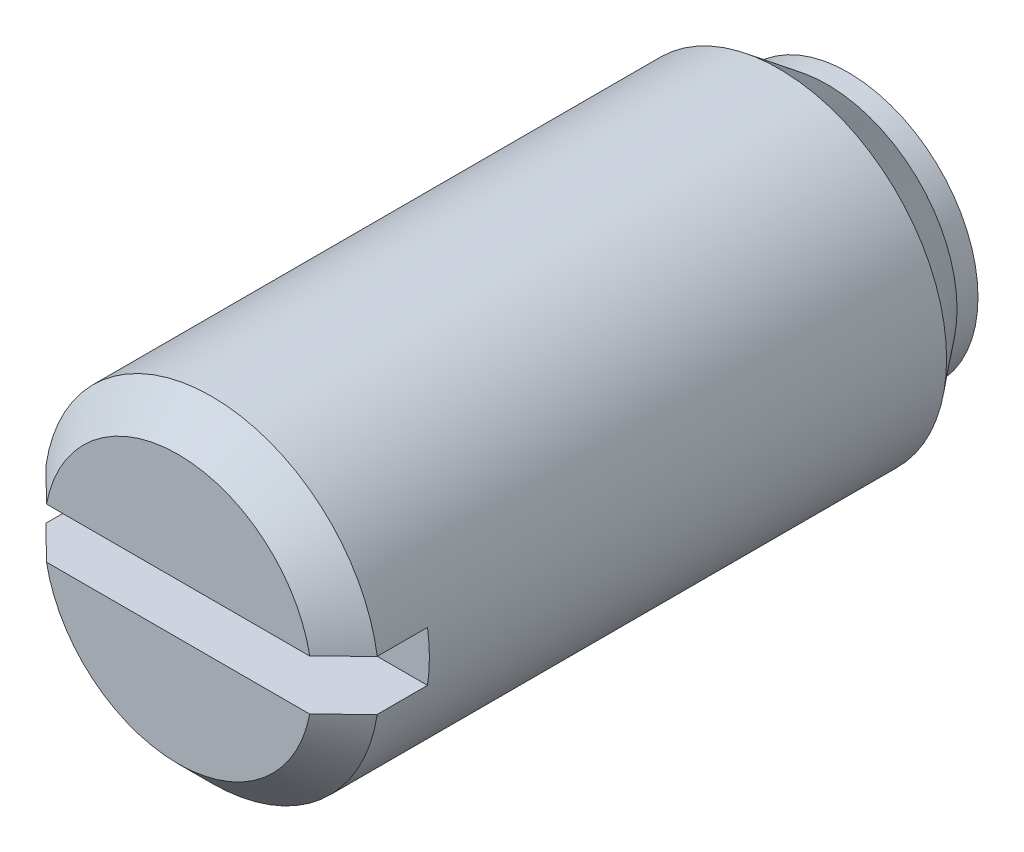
ISO-10303-21;
HEADER;
FILE_DESCRIPTION(('STEP AP214'),'2;1');
FILE_NAME('part.step','',(''),(''),'','','');
FILE_SCHEMA(('AUTOMOTIVE_DESIGN { 1 0 10303 214 1 1 1 1 }'));
ENDSEC;
DATA;
#1=APPLICATION_CONTEXT('core data for automotive mechanical design processes');
#2=APPLICATION_PROTOCOL_DEFINITION('international standard','automotive_design',2000,#1);
#3=PRODUCT_CONTEXT('',#1,'mechanical');
#4=PRODUCT('Part','Part','',(#3));
#5=PRODUCT_RELATED_PRODUCT_CATEGORY('part','',(#4));
#6=PRODUCT_DEFINITION_FORMATION('','',#4);
#7=PRODUCT_DEFINITION_CONTEXT('part definition',#1,'design');
#8=PRODUCT_DEFINITION('design','',#6,#7);
#9=PRODUCT_DEFINITION_SHAPE('','',#8);
#10=(LENGTH_UNIT() NAMED_UNIT(*) SI_UNIT(.MILLI.,.METRE.));
#11=(NAMED_UNIT(*) PLANE_ANGLE_UNIT() SI_UNIT($,.RADIAN.));
#12=(NAMED_UNIT(*) SI_UNIT($,.STERADIAN.) SOLID_ANGLE_UNIT());
#13=UNCERTAINTY_MEASURE_WITH_UNIT(LENGTH_MEASURE(1.E-05),#10,'distance_accuracy_value','');
#14=(GEOMETRIC_REPRESENTATION_CONTEXT(3) GLOBAL_UNCERTAINTY_ASSIGNED_CONTEXT((#13)) GLOBAL_UNIT_ASSIGNED_CONTEXT((#10,
#11,#12)) REPRESENTATION_CONTEXT('',''));
#15=CARTESIAN_POINT('',(0.,0.,0.));
#16=DIRECTION('',(0.,0.,1.));
#17=DIRECTION('',(1.,0.,0.));
#18=AXIS2_PLACEMENT_3D('',#15,#16,#17);
#19=CARTESIAN_POINT('',(0.,0.,-2.5));
#20=DIRECTION('',(0.,0.,-1.));
#21=DIRECTION('',(-1.,0.,0.));
#22=AXIS2_PLACEMENT_3D('',#19,#20,#21);
#23=CYLINDRICAL_SURFACE('',#22,4.);
#24=CARTESIAN_POINT('',(0.,0.,3.15));
#25=DIRECTION('',(0.,0.,1.));
#26=DIRECTION('',(1.,0.,0.));
#27=AXIS2_PLACEMENT_3D('',#24,#25,#26);
#28=CIRCLE('',#27,4.);
#29=CARTESIAN_POINT('',(4.,0.,3.15));
#30=VERTEX_POINT('',#29);
#31=EDGE_CURVE('E78',#30,#30,#28,.T.);
#32=ORIENTED_EDGE('',*,*,#31,.T.);
#33=EDGE_LOOP('',(#32));
#34=FACE_BOUND('',#33,.T.);
#35=DIRECTION('',(0.,0.,1.));
#36=VECTOR('',#35,1.);
#37=CARTESIAN_POINT('',(-3.95474398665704,0.6,15.5));
#38=LINE('',#37,#36);
#39=CARTESIAN_POINT('',(-3.95474398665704,0.6,15.5));
#40=VERTEX_POINT('',#39);
#41=CARTESIAN_POINT('',(-3.95474398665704,0.6,16.7));
#42=VERTEX_POINT('',#41);
#43=EDGE_CURVE('E87',#40,#42,#38,.T.);
#44=ORIENTED_EDGE('',*,*,#43,.T.);
#45=CARTESIAN_POINT('',(0.,0.,16.7));
#46=DIRECTION('',(0.,0.,1.));
#47=DIRECTION('',(1.,0.,0.));
#48=AXIS2_PLACEMENT_3D('',#45,#46,#47);
#49=CIRCLE('',#48,4.);
#50=CARTESIAN_POINT('',(3.95474398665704,0.6,16.7));
#51=VERTEX_POINT('',#50);
#52=EDGE_CURVE('E35',#51,#42,#49,.T.);
#53=ORIENTED_EDGE('',*,*,#52,.F.);
#54=DIRECTION('',(0.,0.,1.));
#55=VECTOR('',#54,1.);
#56=CARTESIAN_POINT('',(3.95474398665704,0.6,15.5));
#57=LINE('',#56,#55);
#58=CARTESIAN_POINT('',(3.95474398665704,0.6,15.5));
#59=VERTEX_POINT('',#58);
#60=EDGE_CURVE('E85',#59,#51,#57,.T.);
#61=ORIENTED_EDGE('',*,*,#60,.F.);
#62=CARTESIAN_POINT('',(0.,0.,15.5));
#63=DIRECTION('',(0.,0.,1.));
#64=DIRECTION('',(1.,0.,0.));
#65=AXIS2_PLACEMENT_3D('',#62,#63,#64);
#66=CIRCLE('',#65,4.);
#67=CARTESIAN_POINT('',(3.95474398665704,-0.6,15.5));
#68=VERTEX_POINT('',#67);
#69=EDGE_CURVE('E117',#68,#59,#66,.T.);
#70=ORIENTED_EDGE('',*,*,#69,.F.);
#71=DIRECTION('',(0.,0.,1.));
#72=VECTOR('',#71,1.);
#73=CARTESIAN_POINT('',(3.95474398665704,-0.6,15.5));
#74=LINE('',#73,#72);
#75=CARTESIAN_POINT('',(3.95474398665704,-0.6,16.7));
#76=VERTEX_POINT('',#75);
#77=EDGE_CURVE('E94',#68,#76,#74,.T.);
#78=ORIENTED_EDGE('',*,*,#77,.T.);
#79=CARTESIAN_POINT('',(-3.95474398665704,-0.6,16.7));
#80=VERTEX_POINT('',#79);
#81=EDGE_CURVE('E88',#80,#76,#49,.T.);
#82=ORIENTED_EDGE('',*,*,#81,.F.);
#83=DIRECTION('',(0.,0.,1.));
#84=VECTOR('',#83,1.);
#85=CARTESIAN_POINT('',(-3.95474398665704,-0.6,15.5));
#86=LINE('',#85,#84);
#87=CARTESIAN_POINT('',(-3.95474398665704,-0.6,15.5));
#88=VERTEX_POINT('',#87);
#89=EDGE_CURVE('E99',#88,#80,#86,.T.);
#90=ORIENTED_EDGE('',*,*,#89,.F.);
#91=EDGE_CURVE('E121',#40,#88,#66,.T.);
#92=ORIENTED_EDGE('',*,*,#91,.F.);
#93=EDGE_LOOP('',(#44,#53,#61,#70,#78,#82,#90,#92));
#94=FACE_BOUND('',#93,.T.);
#95=ADVANCED_FACE('F14',(#34,#94),#23,.T.);
#96=CARTESIAN_POINT('',(0.,4.,17.5));
#97=DIRECTION('',(0.,0.,1.));
#98=DIRECTION('',(1.,0.,0.));
#99=AXIS2_PLACEMENT_3D('',#96,#97,#98);
#100=PLANE('',#99);
#101=DIRECTION('',(1.,0.,0.));
#102=VECTOR('',#101,1.);
#103=CARTESIAN_POINT('',(-3.95474398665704,0.6,17.5));
#104=LINE('',#103,#102);
#105=CARTESIAN_POINT('',(-3.14324672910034,0.6,17.5));
#106=VERTEX_POINT('',#105);
#107=CARTESIAN_POINT('',(3.14324672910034,0.6,17.5));
#108=VERTEX_POINT('',#107);
#109=EDGE_CURVE('E123',#106,#108,#104,.T.);
#110=ORIENTED_EDGE('',*,*,#109,.T.);
#111=CARTESIAN_POINT('',(0.,0.,17.5));
#112=DIRECTION('',(0.,0.,1.));
#113=DIRECTION('',(1.,0.,0.));
#114=AXIS2_PLACEMENT_3D('',#111,#112,#113);
#115=CIRCLE('',#114,3.2);
#116=EDGE_CURVE('E73',#108,#106,#115,.T.);
#117=ORIENTED_EDGE('',*,*,#116,.T.);
#118=EDGE_LOOP('',(#110,#117));
#119=FACE_BOUND('',#118,.T.);
#120=ADVANCED_FACE('F165',(#119),#100,.T.);
#121=DIRECTION('',(1.,0.,0.));
#122=VECTOR('',#121,1.);
#123=CARTESIAN_POINT('',(-3.95474398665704,-0.6,17.5));
#124=LINE('',#123,#122);
#125=CARTESIAN_POINT('',(-3.14324672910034,-0.6,17.5));
#126=VERTEX_POINT('',#125);
#127=CARTESIAN_POINT('',(3.14324672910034,-0.6,17.5));
#128=VERTEX_POINT('',#127);
#129=EDGE_CURVE('E125',#126,#128,#124,.T.);
#130=ORIENTED_EDGE('',*,*,#129,.F.);
#131=EDGE_CURVE('E42',#126,#128,#115,.T.);
#132=ORIENTED_EDGE('',*,*,#131,.T.);
#133=EDGE_LOOP('',(#130,#132));
#134=FACE_BOUND('',#133,.T.);
#135=ADVANCED_FACE('F163',(#134),#100,.T.);
#136=CARTESIAN_POINT('',(-3.95474398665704,0.6,15.5));
#137=DIRECTION('',(0.,-1.,0.));
#138=DIRECTION('',(1.,0.,0.));
#139=AXIS2_PLACEMENT_3D('',#136,#137,#138);
#140=PLANE('',#139);
#141=ORIENTED_EDGE('',*,*,#60,.T.);
#142=CARTESIAN_POINT('',(8.72484964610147,0.6,11.9545439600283));
#143=CARTESIAN_POINT('',(8.42307253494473,0.6,12.2556043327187));
#144=CARTESIAN_POINT('',(8.12126401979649,0.599999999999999,12.556633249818));
#145=CARTESIAN_POINT('',(7.51753626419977,0.599999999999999,13.1585946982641));
#146=CARTESIAN_POINT('',(7.21561702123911,0.599999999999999,13.4595272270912));
#147=CARTESIAN_POINT('',(6.61146660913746,0.599999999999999,14.0614151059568));
#148=CARTESIAN_POINT('',(6.3092353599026,0.599999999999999,14.3623703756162));
#149=CARTESIAN_POINT('',(5.7045596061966,0.599999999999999,14.9640522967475));
#150=CARTESIAN_POINT('',(5.40211510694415,0.599999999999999,15.2647789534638));
#151=CARTESIAN_POINT('',(4.79614303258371,0.599999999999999,15.866605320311));
#152=CARTESIAN_POINT('',(4.49261460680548,0.6,16.167704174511));
#153=CARTESIAN_POINT('',(4.03683089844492,0.6,16.6188787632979));
#154=CARTESIAN_POINT('',(3.88481557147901,0.6,16.7691968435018));
#155=CARTESIAN_POINT('',(3.58055718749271,0.6,17.069600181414));
#156=CARTESIAN_POINT('',(3.42831413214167,0.6,17.2196854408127));
#157=CARTESIAN_POINT('',(3.12354818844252,0.6,17.5194662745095));
#158=CARTESIAN_POINT('',(2.97102541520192,0.6,17.6691619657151));
#159=CARTESIAN_POINT('',(2.66545928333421,0.6,17.968029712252));
#160=CARTESIAN_POINT('',(2.51241591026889,0.6,18.1172017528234));
#161=CARTESIAN_POINT('',(2.20550480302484,0.6,18.4146593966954));
#162=CARTESIAN_POINT('',(2.05163717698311,0.6,18.5629451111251));
#163=CARTESIAN_POINT('',(1.8196476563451,0.6,18.7841216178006));
#164=CARTESIAN_POINT('',(1.74212157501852,0.6,18.8576367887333));
#165=CARTESIAN_POINT('',(1.58649006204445,0.6,19.004050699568));
#166=CARTESIAN_POINT('',(1.50838464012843,0.6,19.0769494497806));
#167=CARTESIAN_POINT('',(1.38707702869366,0.6,19.1888042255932));
#168=CARTESIAN_POINT('',(1.34418338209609,0.6,19.2280946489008));
#169=CARTESIAN_POINT('',(1.25805765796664,0.6,19.3063062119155));
#170=CARTESIAN_POINT('',(1.21482556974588,0.6,19.3452273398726));
#171=CARTESIAN_POINT('',(1.12787729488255,0.6,19.4226144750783));
#172=CARTESIAN_POINT('',(1.08416066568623,0.6,19.4610799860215));
#173=CARTESIAN_POINT('',(0.996138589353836,0.6,19.5373278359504));
#174=CARTESIAN_POINT('',(0.951833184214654,0.6,19.5751102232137));
#175=CARTESIAN_POINT('',(0.870575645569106,0.6,19.6428830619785));
#176=CARTESIAN_POINT('',(0.833759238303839,0.6,19.673035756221));
#177=CARTESIAN_POINT('',(0.759401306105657,0.6,19.7324315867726));
#178=CARTESIAN_POINT('',(0.721859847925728,0.6,19.7616748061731));
#179=CARTESIAN_POINT('',(0.645801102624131,0.6,19.8188482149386));
#180=CARTESIAN_POINT('',(0.60728412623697,0.6,19.8467788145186));
#181=CARTESIAN_POINT('',(0.528906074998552,0.6,19.9006691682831));
#182=CARTESIAN_POINT('',(0.489045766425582,0.6,19.926630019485));
#183=CARTESIAN_POINT('',(0.408632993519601,0.6,19.974761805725));
#184=CARTESIAN_POINT('',(0.368134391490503,0.6,19.9970210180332));
#185=CARTESIAN_POINT('',(0.284843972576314,0.6,20.0368235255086));
#186=CARTESIAN_POINT('',(0.242055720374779,0.6,20.0543739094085));
#187=CARTESIAN_POINT('',(0.163289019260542,0.6,20.0790470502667));
#188=CARTESIAN_POINT('',(0.127773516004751,0.6,20.0875872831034));
#189=CARTESIAN_POINT('',(0.0558427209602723,0.6,20.0984461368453));
#190=CARTESIAN_POINT('',(0.0194301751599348,0.6,20.1007818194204));
#191=CARTESIAN_POINT('',(-0.0532482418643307,0.6,20.0987417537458));
#192=CARTESIAN_POINT('',(-0.0895138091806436,0.6,20.0943558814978));
#193=CARTESIAN_POINT('',(-0.160885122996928,0.6,20.0797976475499));
#194=CARTESIAN_POINT('',(-0.195987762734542,0.6,20.0696109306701));
#195=CARTESIAN_POINT('',(-0.270735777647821,0.6,20.0428347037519));
#196=CARTESIAN_POINT('',(-0.310077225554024,0.6,20.0254281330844));
#197=CARTESIAN_POINT('',(-0.386899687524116,0.6,19.9868482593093));
#198=CARTESIAN_POINT('',(-0.424376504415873,0.6,19.965666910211));
#199=CARTESIAN_POINT('',(-0.498167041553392,0.6,19.9206995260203));
#200=CARTESIAN_POINT('',(-0.534467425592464,0.6,19.8968919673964));
#201=CARTESIAN_POINT('',(-0.605900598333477,0.6,19.8476808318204));
#202=CARTESIAN_POINT('',(-0.641034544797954,0.6,19.8222789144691));
#203=CARTESIAN_POINT('',(-0.714169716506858,0.6,19.7675905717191));
#204=CARTESIAN_POINT('',(-0.752076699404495,0.6,19.7381789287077));
#205=CARTESIAN_POINT('',(-0.827139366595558,0.6,19.6784090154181));
#206=CARTESIAN_POINT('',(-0.864294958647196,0.6,19.6480506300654));
#207=CARTESIAN_POINT('',(-0.97495815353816,0.6,19.5559498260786));
#208=CARTESIAN_POINT('',(-1.04763018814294,0.6,19.4932064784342));
#209=CARTESIAN_POINT('',(-1.19177377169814,0.6,19.3661380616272));
#210=CARTESIAN_POINT('',(-1.26324315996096,0.6,19.3018105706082));
#211=CARTESIAN_POINT('',(-1.40531184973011,0.6,19.172239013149));
#212=CARTESIAN_POINT('',(-1.47591136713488,0.6,19.1069951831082));
#213=CARTESIAN_POINT('',(-1.61618239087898,0.6,18.9762226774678));
#214=CARTESIAN_POINT('',(-1.68585677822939,0.6,18.910697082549));
#215=CARTESIAN_POINT('',(-1.82480588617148,0.6,18.7792150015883));
#216=CARTESIAN_POINT('',(-1.89408058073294,0.6,18.7132584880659));
#217=CARTESIAN_POINT('',(-2.10133483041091,0.6,18.5150608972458));
#218=CARTESIAN_POINT('',(-2.2388792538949,0.6,18.3823652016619));
#219=CARTESIAN_POINT('',(-2.50954414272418,0.6,18.1199289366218));
#220=CARTESIAN_POINT('',(-2.64268263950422,0.6,17.990206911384));
#221=CARTESIAN_POINT('',(-2.90854837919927,0.6,17.7303418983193));
#222=CARTESIAN_POINT('',(-3.04127562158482,0.6,17.6001989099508));
#223=CARTESIAN_POINT('',(-3.43905384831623,0.6,17.2093512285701));
#224=CARTESIAN_POINT('',(-3.70369714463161,0.6,16.9482318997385));
#225=CARTESIAN_POINT('',(-4.23254771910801,0.6,16.4253129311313));
#226=CARTESIAN_POINT('',(-4.4967547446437,0.6,16.1635130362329));
#227=CARTESIAN_POINT('',(-5.02483353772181,0.6,15.6395789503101));
#228=CARTESIAN_POINT('',(-5.28870530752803,0.6,15.3774447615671));
#229=CARTESIAN_POINT('',(-5.81717793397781,0.6,14.8520296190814));
#230=CARTESIAN_POINT('',(-6.08177803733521,0.6,14.5887479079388));
#231=CARTESIAN_POINT('',(-6.61083496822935,0.6,14.0620393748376));
#232=CARTESIAN_POINT('',(-6.87529179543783,0.6,13.7986125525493));
#233=CARTESIAN_POINT('',(-7.40397441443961,0.6,13.2717871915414));
#234=CARTESIAN_POINT('',(-7.66820025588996,0.6,13.0083887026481));
#235=CARTESIAN_POINT('',(-8.19657567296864,0.6,12.4815165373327));
#236=CARTESIAN_POINT('',(-8.46072524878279,0.6,12.218042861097));
#237=CARTESIAN_POINT('',(-8.72484964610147,0.6,11.9545439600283));
#238=B_SPLINE_CURVE_WITH_KNOTS('',3,(#142,#143,#144,#145,#146,#147,#148,#149,#150,#151,#152,
#153,#154,#155,#156,#157,#158,#159,#160,#161,#162,#163,#164,#165,#166,#167,#168,#169,#170,#171,
#172,#173,#174,#175,#176,#177,#178,#179,#180,#181,#182,#183,#184,#185,#186,#187,#188,#189,#190,
#191,#192,#193,#194,#195,#196,#197,#198,#199,#200,#201,#202,#203,#204,#205,#206,#207,#208,#209,
#210,#211,#212,#213,#214,#215,#216,#217,#218,#219,#220,#221,#222,#223,#224,#225,#226,#227,#228,
#229,#230,#231,#232,#233,#234,#235,#236,#237),.UNSPECIFIED.,.F.,.F.,(4,2,2,2,2,2,2,2,2,2,2,2,2,
2,2,2,2,2,2,2,2,2,2,2,2,2,2,2,2,2,2,2,2,2,2,2,2,2,2,2,2,2,2,2,2,2,2,4),(0.,1.27881234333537,
2.55765575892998,3.83721037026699,5.11673468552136,6.3993525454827,7.04070847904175,
7.68205973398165,8.32318898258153,8.96433615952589,9.60540118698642,9.92591915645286,
10.2464317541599,10.4209364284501,10.59544663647,10.7701320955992,10.9448051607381,
11.0875598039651,11.2303013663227,11.3729980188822,11.5156146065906,11.6540826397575,
11.7923410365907,11.9014904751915,12.010339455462,12.1193525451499,12.2286365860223,
12.3573778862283,12.4863969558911,12.6165654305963,12.7466005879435,12.8905156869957,
13.034448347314,13.3224348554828,13.6108929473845,13.8992779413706,14.1862132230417,
14.4731669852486,15.0465200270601,15.604177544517,16.1618357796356,17.2771697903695,
18.3930103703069,19.5088433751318,20.6286532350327,21.7484656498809,22.8677272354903,
23.986986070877),.UNSPECIFIED.);
#239=EDGE_CURVE('E70',#51,#108,#238,.T.);
#240=ORIENTED_EDGE('',*,*,#239,.T.);
#241=ORIENTED_EDGE('',*,*,#109,.F.);
#242=EDGE_CURVE('E79',#106,#42,#238,.T.);
#243=ORIENTED_EDGE('',*,*,#242,.T.);
#244=ORIENTED_EDGE('',*,*,#43,.F.);
#245=DIRECTION('',(1.,0.,0.));
#246=VECTOR('',#245,1.);
#247=CARTESIAN_POINT('',(-3.95474398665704,0.6,15.5));
#248=LINE('',#247,#246);
#249=EDGE_CURVE('E93',#40,#59,#248,.T.);
#250=ORIENTED_EDGE('',*,*,#249,.T.);
#251=EDGE_LOOP('',(#141,#240,#241,#243,#244,#250));
#252=FACE_BOUND('',#251,.T.);
#253=ADVANCED_FACE('F91',(#252),#140,.T.);
#254=CARTESIAN_POINT('',(-3.95474398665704,-0.6,15.5));
#255=DIRECTION('',(0.,-1.,0.));
#256=DIRECTION('',(1.,0.,0.));
#257=AXIS2_PLACEMENT_3D('',#254,#255,#256);
#258=PLANE('',#257);
#259=CARTESIAN_POINT('',(8.72484964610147,-0.6,11.9545439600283));
#260=CARTESIAN_POINT('',(8.42307253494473,-0.6,12.2556043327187));
#261=CARTESIAN_POINT('',(8.12126401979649,-0.600000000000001,12.556633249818));
#262=CARTESIAN_POINT('',(7.51753626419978,-0.600000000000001,13.1585946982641));
#263=CARTESIAN_POINT('',(7.21561702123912,-0.600000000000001,13.4595272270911));
#264=CARTESIAN_POINT('',(6.61146660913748,-0.600000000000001,14.0614151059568));
#265=CARTESIAN_POINT('',(6.30923535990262,-0.600000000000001,14.3623703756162));
#266=CARTESIAN_POINT('',(5.70455960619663,-0.600000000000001,14.9640522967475));
#267=CARTESIAN_POINT('',(5.40211510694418,-0.600000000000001,15.2647789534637));
#268=CARTESIAN_POINT('',(4.79614303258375,-0.600000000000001,15.866605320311));
#269=CARTESIAN_POINT('',(4.49261460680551,-0.6,16.167704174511));
#270=CARTESIAN_POINT('',(4.03683089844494,-0.6,16.6188787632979));
#271=CARTESIAN_POINT('',(3.88481557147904,-0.6,16.7691968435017));
#272=CARTESIAN_POINT('',(3.58055718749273,-0.6,17.0696001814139));
#273=CARTESIAN_POINT('',(3.42831413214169,-0.6,17.2196854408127));
#274=CARTESIAN_POINT('',(3.12354818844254,-0.6,17.5194662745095));
#275=CARTESIAN_POINT('',(2.97102541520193,-0.6,17.6691619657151));
#276=CARTESIAN_POINT('',(2.66545928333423,-0.6,17.968029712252));
#277=CARTESIAN_POINT('',(2.5124159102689,-0.6,18.1172017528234));
#278=CARTESIAN_POINT('',(2.20550480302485,-0.6,18.4146593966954));
#279=CARTESIAN_POINT('',(2.05163717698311,-0.6,18.5629451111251));
#280=CARTESIAN_POINT('',(1.8196476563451,-0.6,18.7841216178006));
#281=CARTESIAN_POINT('',(1.74212157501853,-0.6,18.8576367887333));
#282=CARTESIAN_POINT('',(1.58649006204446,-0.6,19.004050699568));
#283=CARTESIAN_POINT('',(1.50838464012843,-0.6,19.0769494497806));
#284=CARTESIAN_POINT('',(1.38707702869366,-0.6,19.1888042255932));
#285=CARTESIAN_POINT('',(1.34418338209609,-0.6,19.2280946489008));
#286=CARTESIAN_POINT('',(1.25805765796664,-0.6,19.3063062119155));
#287=CARTESIAN_POINT('',(1.21482556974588,-0.6,19.3452273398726));
#288=CARTESIAN_POINT('',(1.12787729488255,-0.6,19.4226144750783));
#289=CARTESIAN_POINT('',(1.08416066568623,-0.6,19.4610799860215));
#290=CARTESIAN_POINT('',(0.996138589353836,-0.6,19.5373278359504));
#291=CARTESIAN_POINT('',(0.951833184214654,-0.6,19.5751102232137));
#292=CARTESIAN_POINT('',(0.870575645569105,-0.6,19.6428830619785));
#293=CARTESIAN_POINT('',(0.833759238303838,-0.6,19.673035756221));
#294=CARTESIAN_POINT('',(0.759401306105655,-0.6,19.7324315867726));
#295=CARTESIAN_POINT('',(0.721859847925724,-0.6,19.7616748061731));
#296=CARTESIAN_POINT('',(0.645801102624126,-0.6,19.8188482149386));
#297=CARTESIAN_POINT('',(0.607284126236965,-0.6,19.8467788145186));
#298=CARTESIAN_POINT('',(0.528906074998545,-0.6,19.9006691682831));
#299=CARTESIAN_POINT('',(0.489045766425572,-0.6,19.926630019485));
#300=CARTESIAN_POINT('',(0.408632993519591,-0.6,19.974761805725));
#301=CARTESIAN_POINT('',(0.368134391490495,-0.6,19.9970210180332));
#302=CARTESIAN_POINT('',(0.284843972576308,-0.6,20.0368235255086));
#303=CARTESIAN_POINT('',(0.242055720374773,-0.6,20.0543739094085));
#304=CARTESIAN_POINT('',(0.163289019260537,-0.6,20.0790470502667));
#305=CARTESIAN_POINT('',(0.127773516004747,-0.6,20.0875872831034));
#306=CARTESIAN_POINT('',(0.0558427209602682,-0.6,20.0984461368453));
#307=CARTESIAN_POINT('',(0.0194301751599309,-0.6,20.1007818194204));
#308=CARTESIAN_POINT('',(-0.0532482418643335,-0.6,20.0987417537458));
#309=CARTESIAN_POINT('',(-0.0895138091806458,-0.6,20.0943558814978));
#310=CARTESIAN_POINT('',(-0.16088512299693,-0.6,20.0797976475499));
#311=CARTESIAN_POINT('',(-0.195987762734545,-0.6,20.0696109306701));
#312=CARTESIAN_POINT('',(-0.270735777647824,-0.6,20.0428347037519));
#313=CARTESIAN_POINT('',(-0.310077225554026,-0.6,20.0254281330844));
#314=CARTESIAN_POINT('',(-0.386899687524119,-0.6,19.9868482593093));
#315=CARTESIAN_POINT('',(-0.424376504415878,-0.6,19.965666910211));
#316=CARTESIAN_POINT('',(-0.498167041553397,-0.6,19.9206995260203));
#317=CARTESIAN_POINT('',(-0.534467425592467,-0.6,19.8968919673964));
#318=CARTESIAN_POINT('',(-0.605900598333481,-0.6,19.8476808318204));
#319=CARTESIAN_POINT('',(-0.641034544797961,-0.6,19.8222789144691));
#320=CARTESIAN_POINT('',(-0.714169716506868,-0.6,19.7675905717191));
#321=CARTESIAN_POINT('',(-0.752076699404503,-0.6,19.7381789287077));
#322=CARTESIAN_POINT('',(-0.827139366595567,-0.6,19.6784090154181));
#323=CARTESIAN_POINT('',(-0.864294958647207,-0.6,19.6480506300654));
#324=CARTESIAN_POINT('',(-0.974958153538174,-0.6,19.5559498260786));
#325=CARTESIAN_POINT('',(-1.04763018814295,-0.6,19.4932064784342));
#326=CARTESIAN_POINT('',(-1.19177377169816,-0.6,19.3661380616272));
#327=CARTESIAN_POINT('',(-1.26324315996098,-0.6,19.3018105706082));
#328=CARTESIAN_POINT('',(-1.40531184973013,-0.6,19.172239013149));
#329=CARTESIAN_POINT('',(-1.4759113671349,-0.6,19.1069951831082));
#330=CARTESIAN_POINT('',(-1.616182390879,-0.6,18.9762226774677));
#331=CARTESIAN_POINT('',(-1.68585677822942,-0.6,18.910697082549));
#332=CARTESIAN_POINT('',(-1.8248058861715,-0.6,18.7792150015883));
#333=CARTESIAN_POINT('',(-1.89408058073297,-0.6,18.7132584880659));
#334=CARTESIAN_POINT('',(-2.10133483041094,-0.6,18.5150608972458));
#335=CARTESIAN_POINT('',(-2.23887925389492,-0.6,18.3823652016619));
#336=CARTESIAN_POINT('',(-2.50954414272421,-0.6,18.1199289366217));
#337=CARTESIAN_POINT('',(-2.64268263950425,-0.6,17.990206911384));
#338=CARTESIAN_POINT('',(-2.90854837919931,-0.6,17.7303418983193));
#339=CARTESIAN_POINT('',(-3.04127562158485,-0.6,17.6001989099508));
#340=CARTESIAN_POINT('',(-3.43905384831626,-0.6,17.20935122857));
#341=CARTESIAN_POINT('',(-3.70369714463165,-0.6,16.9482318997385));
#342=CARTESIAN_POINT('',(-4.23254771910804,-0.6,16.4253129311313));
#343=CARTESIAN_POINT('',(-4.49675474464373,-0.6,16.1635130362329));
#344=CARTESIAN_POINT('',(-5.02483353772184,-0.6,15.63957895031));
#345=CARTESIAN_POINT('',(-5.28870530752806,-0.6,15.377444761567));
#346=CARTESIAN_POINT('',(-5.81717793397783,-0.6,14.8520296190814));
#347=CARTESIAN_POINT('',(-6.08177803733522,-0.6,14.5887479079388));
#348=CARTESIAN_POINT('',(-6.61083496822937,-0.6,14.0620393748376));
#349=CARTESIAN_POINT('',(-6.87529179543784,-0.6,13.7986125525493));
#350=CARTESIAN_POINT('',(-7.40397441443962,-0.6,13.2717871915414));
#351=CARTESIAN_POINT('',(-7.66820025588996,-0.6,13.0083887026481));
#352=CARTESIAN_POINT('',(-8.19657567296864,-0.6,12.4815165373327));
#353=CARTESIAN_POINT('',(-8.46072524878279,-0.6,12.218042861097));
#354=CARTESIAN_POINT('',(-8.72484964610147,-0.6,11.9545439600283));
#355=B_SPLINE_CURVE_WITH_KNOTS('',3,(#259,#260,#261,#262,#263,#264,#265,#266,#267,#268,#269,
#270,#271,#272,#273,#274,#275,#276,#277,#278,#279,#280,#281,#282,#283,#284,#285,#286,#287,#288,
#289,#290,#291,#292,#293,#294,#295,#296,#297,#298,#299,#300,#301,#302,#303,#304,#305,#306,#307,
#308,#309,#310,#311,#312,#313,#314,#315,#316,#317,#318,#319,#320,#321,#322,#323,#324,#325,#326,
#327,#328,#329,#330,#331,#332,#333,#334,#335,#336,#337,#338,#339,#340,#341,#342,#343,#344,#345,
#346,#347,#348,#349,#350,#351,#352,#353,#354),.UNSPECIFIED.,.F.,.F.,(4,2,2,2,2,2,2,2,2,2,2,2,2,
2,2,2,2,2,2,2,2,2,2,2,2,2,2,2,2,2,2,2,2,2,2,2,2,2,2,2,2,2,2,2,2,2,2,4),(0.,1.27881234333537,
2.55765575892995,3.83721037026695,5.11673468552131,6.39935254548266,7.04070847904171,
7.68205973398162,8.3231889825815,8.96433615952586,9.60540118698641,9.92591915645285,
10.2464317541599,10.4209364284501,10.59544663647,10.7701320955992,10.9448051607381,
11.0875598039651,11.2303013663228,11.3729980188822,11.5156146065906,11.6540826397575,
11.7923410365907,11.9014904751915,12.010339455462,12.1193525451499,12.2286365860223,
12.3573778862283,12.4863969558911,12.6165654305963,12.7466005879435,12.8905156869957,
13.034448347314,13.3224348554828,13.6108929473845,13.8992779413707,14.1862132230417,
14.4731669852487,15.0465200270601,15.604177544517,16.1618357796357,17.2771697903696,
18.3930103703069,19.5088433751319,20.6286532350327,21.7484656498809,22.8677272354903,
23.986986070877),.UNSPECIFIED.);
#356=EDGE_CURVE('E9',#76,#128,#355,.T.);
#357=ORIENTED_EDGE('',*,*,#356,.F.);
#358=ORIENTED_EDGE('',*,*,#77,.F.);
#359=DIRECTION('',(1.,0.,0.));
#360=VECTOR('',#359,1.);
#361=CARTESIAN_POINT('',(-3.95474398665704,-0.6,15.5));
#362=LINE('',#361,#360);
#363=EDGE_CURVE('E116',#88,#68,#362,.T.);
#364=ORIENTED_EDGE('',*,*,#363,.F.);
#365=ORIENTED_EDGE('',*,*,#89,.T.);
#366=EDGE_CURVE('E18',#126,#80,#355,.T.);
#367=ORIENTED_EDGE('',*,*,#366,.F.);
#368=ORIENTED_EDGE('',*,*,#129,.T.);
#369=EDGE_LOOP('',(#357,#358,#364,#365,#367,#368));
#370=FACE_BOUND('',#369,.T.);
#371=ADVANCED_FACE('F115',(#370),#258,.F.);
#372=CARTESIAN_POINT('',(0.,0.,15.5));
#373=DIRECTION('',(0.,0.,1.));
#374=DIRECTION('',(1.,0.,0.));
#375=AXIS2_PLACEMENT_3D('',#372,#373,#374);
#376=PLANE('',#375);
#377=ORIENTED_EDGE('',*,*,#91,.T.);
#378=ORIENTED_EDGE('',*,*,#363,.T.);
#379=ORIENTED_EDGE('',*,*,#69,.T.);
#380=ORIENTED_EDGE('',*,*,#249,.F.);
#381=EDGE_LOOP('',(#377,#378,#379,#380));
#382=FACE_BOUND('',#381,.T.);
#383=ADVANCED_FACE('F153',(#382),#376,.T.);
#384=CARTESIAN_POINT('',(0.,0.,20.1877779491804));
#385=DIRECTION('',(0.,0.,1.));
#386=DIRECTION('',(1.,0.,0.));
#387=AXIS2_PLACEMENT_3D('',#384,#385,#386);
#388=CYLINDRICAL_SURFACE('',#387,3.1);
#389=CARTESIAN_POINT('',(0.,0.,1.5));
#390=DIRECTION('',(0.,0.,1.));
#391=DIRECTION('',(1.,0.,0.));
#392=AXIS2_PLACEMENT_3D('',#389,#390,#391);
#393=CIRCLE('',#392,3.1);
#394=CARTESIAN_POINT('',(3.1,0.,1.5));
#395=VERTEX_POINT('',#394);
#396=EDGE_CURVE('E127',#395,#395,#393,.T.);
#397=ORIENTED_EDGE('',*,*,#396,.T.);
#398=EDGE_LOOP('',(#397));
#399=FACE_BOUND('',#398,.T.);
#400=CARTESIAN_POINT('',(0.,0.,2.));
#401=DIRECTION('',(0.,0.,1.));
#402=DIRECTION('',(1.,0.,0.));
#403=AXIS2_PLACEMENT_3D('',#400,#401,#402);
#404=CIRCLE('',#403,3.1);
#405=CARTESIAN_POINT('',(3.1,0.,2.));
#406=VERTEX_POINT('',#405);
#407=EDGE_CURVE('E130',#406,#406,#404,.T.);
#408=ORIENTED_EDGE('',*,*,#407,.F.);
#409=EDGE_LOOP('',(#408));
#410=FACE_BOUND('',#409,.T.);
#411=ADVANCED_FACE('F149',(#399,#410),#388,.T.);
#412=CARTESIAN_POINT('',(0.,0.,3.15));
#413=DIRECTION('',(0.,0.,1.));
#414=DIRECTION('',(1.,0.,0.));
#415=AXIS2_PLACEMENT_3D('',#412,#413,#414);
#416=CONICAL_SURFACE('',#415,4.,0.664046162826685);
#417=ORIENTED_EDGE('',*,*,#407,.T.);
#418=EDGE_LOOP('',(#417));
#419=FACE_BOUND('',#418,.T.);
#420=ORIENTED_EDGE('',*,*,#31,.F.);
#421=EDGE_LOOP('',(#420));
#422=FACE_BOUND('',#421,.T.);
#423=ADVANCED_FACE('F145',(#419,#422),#416,.T.);
#424=CARTESIAN_POINT('',(0.,0.,2.5));
#425=DIRECTION('',(-1.,0.,0.));
#426=DIRECTION('',(0.,0.,1.));
#427=AXIS2_PLACEMENT_3D('',#424,#425,#426);
#428=SPHERICAL_SURFACE('',#427,2.5);
#429=CARTESIAN_POINT('',(0.,0.,2.5));
#430=DIRECTION('',(0.,0.,-1.));
#431=DIRECTION('',(-1.,0.,0.));
#432=AXIS2_PLACEMENT_3D('',#429,#430,#431);
#433=SPHERICAL_SURFACE('',#432,2.5);
#434=CARTESIAN_POINT('',(0.,0.,1.5));
#435=DIRECTION('',(0.,0.,-1.));
#436=DIRECTION('',(-1.,0.,0.));
#437=AXIS2_PLACEMENT_3D('',#434,#435,#436);
#438=CIRCLE('',#437,2.29128784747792);
#439=CARTESIAN_POINT('',(-2.29128784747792,0.,1.5));
#440=VERTEX_POINT('',#439);
#441=EDGE_CURVE('E96',#440,#440,#438,.T.);
#442=ORIENTED_EDGE('',*,*,#441,.T.);
#443=EDGE_LOOP('',(#442));
#444=FACE_BOUND('',#443,.T.);
#445=ADVANCED_FACE('F16',(#444),#433,.T.);
#446=CARTESIAN_POINT('',(0.,2.29128784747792,1.5));
#447=DIRECTION('',(0.,0.,-1.));
#448=DIRECTION('',(-1.,0.,0.));
#449=AXIS2_PLACEMENT_3D('',#446,#447,#448);
#450=PLANE('',#449);
#451=ORIENTED_EDGE('',*,*,#441,.F.);
#452=EDGE_LOOP('',(#451));
#453=FACE_BOUND('',#452,.T.);
#454=ORIENTED_EDGE('',*,*,#396,.F.);
#455=EDGE_LOOP('',(#454));
#456=FACE_BOUND('',#455,.T.);
#457=ADVANCED_FACE('F172',(#453,#456),#450,.T.);
#458=CARTESIAN_POINT('',(0.,0.,17.5));
#459=DIRECTION('',(0.,0.,-1.));
#460=DIRECTION('',(-1.,0.,0.));
#461=AXIS2_PLACEMENT_3D('',#458,#459,#460);
#462=CONICAL_SURFACE('',#461,3.2,0.785398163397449);
#463=ORIENTED_EDGE('',*,*,#356,.T.);
#464=ORIENTED_EDGE('',*,*,#131,.F.);
#465=ORIENTED_EDGE('',*,*,#366,.T.);
#466=ORIENTED_EDGE('',*,*,#81,.T.);
#467=EDGE_LOOP('',(#463,#464,#465,#466));
#468=FACE_BOUND('',#467,.T.);
#469=ADVANCED_FACE('F106',(#468),#462,.T.);
#470=ORIENTED_EDGE('',*,*,#52,.T.);
#471=ORIENTED_EDGE('',*,*,#242,.F.);
#472=ORIENTED_EDGE('',*,*,#116,.F.);
#473=ORIENTED_EDGE('',*,*,#239,.F.);
#474=EDGE_LOOP('',(#470,#471,#472,#473));
#475=FACE_BOUND('',#474,.T.);
#476=ADVANCED_FACE('F71',(#475),#462,.T.);
#477=CLOSED_SHELL('',(#95,#120,#135,#253,#371,#383,#411,#423,#445,#457,#469,#476));
#478=MANIFOLD_SOLID_BREP('B1',#477);
#479=ADVANCED_BREP_SHAPE_REPRESENTATION('',(#18,#478),#14);
#480=SHAPE_DEFINITION_REPRESENTATION(#9,#479);
ENDSEC;
END-ISO-10303-21;
